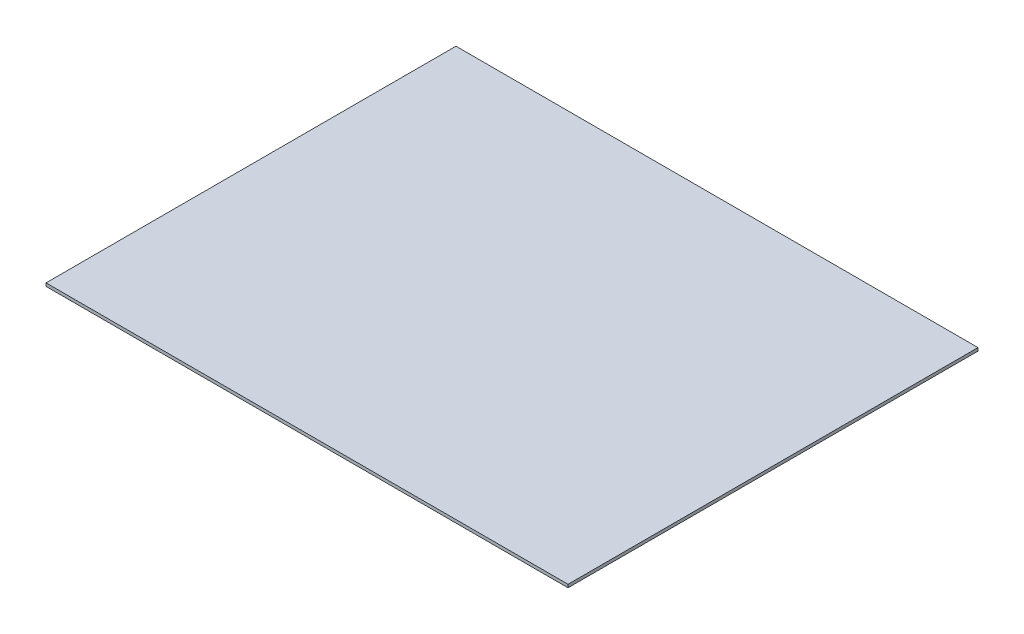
ISO-10303-21;
HEADER;
FILE_DESCRIPTION(('STEP AP214'),'2;1');
FILE_NAME('part.step','',(''),(''),'','','');
FILE_SCHEMA(('AUTOMOTIVE_DESIGN { 1 0 10303 214 1 1 1 1 }'));
ENDSEC;
DATA;
#1=APPLICATION_CONTEXT('core data for automotive mechanical design processes');
#2=APPLICATION_PROTOCOL_DEFINITION('international standard','automotive_design',2000,#1);
#3=PRODUCT_CONTEXT('',#1,'mechanical');
#4=PRODUCT('Part','Part','',(#3));
#5=PRODUCT_RELATED_PRODUCT_CATEGORY('part','',(#4));
#6=PRODUCT_DEFINITION_FORMATION('','',#4);
#7=PRODUCT_DEFINITION_CONTEXT('part definition',#1,'design');
#8=PRODUCT_DEFINITION('design','',#6,#7);
#9=PRODUCT_DEFINITION_SHAPE('','',#8);
#10=(LENGTH_UNIT() NAMED_UNIT(*) SI_UNIT(.MILLI.,.METRE.));
#11=(NAMED_UNIT(*) PLANE_ANGLE_UNIT() SI_UNIT($,.RADIAN.));
#12=(NAMED_UNIT(*) SI_UNIT($,.STERADIAN.) SOLID_ANGLE_UNIT());
#13=UNCERTAINTY_MEASURE_WITH_UNIT(LENGTH_MEASURE(1.E-05),#10,'distance_accuracy_value','');
#14=(GEOMETRIC_REPRESENTATION_CONTEXT(3) GLOBAL_UNCERTAINTY_ASSIGNED_CONTEXT((#13)) GLOBAL_UNIT_ASSIGNED_CONTEXT((#10,
#11,#12)) REPRESENTATION_CONTEXT('',''));
#15=CARTESIAN_POINT('',(0.,0.,0.));
#16=DIRECTION('',(0.,0.,1.));
#17=DIRECTION('',(1.,0.,0.));
#18=AXIS2_PLACEMENT_3D('',#15,#16,#17);
#19=CARTESIAN_POINT('',(170.,2.,133.5));
#20=DIRECTION('',(-1.,0.,0.));
#21=DIRECTION('',(0.,0.,1.));
#22=AXIS2_PLACEMENT_3D('',#19,#20,#21);
#23=PLANE('',#22);
#24=DIRECTION('',(0.,0.,-1.));
#25=VECTOR('',#24,1.);
#26=CARTESIAN_POINT('',(170.,0.,133.5));
#27=LINE('',#26,#25);
#28=CARTESIAN_POINT('',(170.,0.,133.5));
#29=VERTEX_POINT('',#28);
#30=CARTESIAN_POINT('',(170.,0.,-133.5));
#31=VERTEX_POINT('',#30);
#32=EDGE_CURVE('E93',#29,#31,#27,.T.);
#33=ORIENTED_EDGE('',*,*,#32,.T.);
#34=DIRECTION('',(0.,-1.,0.));
#35=VECTOR('',#34,1.);
#36=CARTESIAN_POINT('',(170.,2.,-133.5));
#37=LINE('',#36,#35);
#38=CARTESIAN_POINT('',(170.,2.,-133.5));
#39=VERTEX_POINT('',#38);
#40=EDGE_CURVE('E11',#39,#31,#37,.T.);
#41=ORIENTED_EDGE('',*,*,#40,.F.);
#42=DIRECTION('',(0.,0.,-1.));
#43=VECTOR('',#42,1.);
#44=CARTESIAN_POINT('',(170.,2.,133.5));
#45=LINE('',#44,#43);
#46=CARTESIAN_POINT('',(170.,2.,133.5));
#47=VERTEX_POINT('',#46);
#48=EDGE_CURVE('E81',#47,#39,#45,.T.);
#49=ORIENTED_EDGE('',*,*,#48,.F.);
#50=DIRECTION('',(0.,-1.,0.));
#51=VECTOR('',#50,1.);
#52=CARTESIAN_POINT('',(170.,2.,133.5));
#53=LINE('',#52,#51);
#54=EDGE_CURVE('E89',#47,#29,#53,.T.);
#55=ORIENTED_EDGE('',*,*,#54,.T.);
#56=EDGE_LOOP('',(#33,#41,#49,#55));
#57=FACE_BOUND('',#56,.T.);
#58=ADVANCED_FACE('F30',(#57),#23,.F.);
#59=CARTESIAN_POINT('',(-170.,2.,-133.5));
#60=DIRECTION('',(0.,0.,1.));
#61=DIRECTION('',(1.,0.,0.));
#62=AXIS2_PLACEMENT_3D('',#59,#60,#61);
#63=PLANE('',#62);
#64=DIRECTION('',(-1.,0.,0.));
#65=VECTOR('',#64,1.);
#66=CARTESIAN_POINT('',(-170.,0.,-133.5));
#67=LINE('',#66,#65);
#68=CARTESIAN_POINT('',(-170.,0.,-133.5));
#69=VERTEX_POINT('',#68);
#70=EDGE_CURVE('E85',#31,#69,#67,.T.);
#71=ORIENTED_EDGE('',*,*,#70,.T.);
#72=DIRECTION('',(0.,-1.,0.));
#73=VECTOR('',#72,1.);
#74=CARTESIAN_POINT('',(-170.,2.,-133.5));
#75=LINE('',#74,#73);
#76=CARTESIAN_POINT('',(-170.,2.,-133.5));
#77=VERTEX_POINT('',#76);
#78=EDGE_CURVE('E38',#77,#69,#75,.T.);
#79=ORIENTED_EDGE('',*,*,#78,.F.);
#80=DIRECTION('',(-1.,0.,0.));
#81=VECTOR('',#80,1.);
#82=CARTESIAN_POINT('',(-170.,2.,-133.5));
#83=LINE('',#82,#81);
#84=EDGE_CURVE('E76',#39,#77,#83,.T.);
#85=ORIENTED_EDGE('',*,*,#84,.F.);
#86=ORIENTED_EDGE('',*,*,#40,.T.);
#87=EDGE_LOOP('',(#71,#79,#85,#86));
#88=FACE_BOUND('',#87,.T.);
#89=ADVANCED_FACE('F84',(#88),#63,.F.);
#90=CARTESIAN_POINT('',(-170.,2.,133.5));
#91=DIRECTION('',(1.,0.,0.));
#92=DIRECTION('',(0.,0.,-1.));
#93=AXIS2_PLACEMENT_3D('',#90,#91,#92);
#94=PLANE('',#93);
#95=DIRECTION('',(0.,0.,1.));
#96=VECTOR('',#95,1.);
#97=CARTESIAN_POINT('',(-170.,0.,133.5));
#98=LINE('',#97,#96);
#99=CARTESIAN_POINT('',(-170.,0.,133.5));
#100=VERTEX_POINT('',#99);
#101=EDGE_CURVE('E63',#69,#100,#98,.T.);
#102=ORIENTED_EDGE('',*,*,#101,.T.);
#103=DIRECTION('',(0.,-1.,0.));
#104=VECTOR('',#103,1.);
#105=CARTESIAN_POINT('',(-170.,2.,133.5));
#106=LINE('',#105,#104);
#107=CARTESIAN_POINT('',(-170.,2.,133.5));
#108=VERTEX_POINT('',#107);
#109=EDGE_CURVE('E86',#108,#100,#106,.T.);
#110=ORIENTED_EDGE('',*,*,#109,.F.);
#111=DIRECTION('',(0.,0.,1.));
#112=VECTOR('',#111,1.);
#113=CARTESIAN_POINT('',(-170.,2.,133.5));
#114=LINE('',#113,#112);
#115=EDGE_CURVE('E79',#77,#108,#114,.T.);
#116=ORIENTED_EDGE('',*,*,#115,.F.);
#117=ORIENTED_EDGE('',*,*,#78,.T.);
#118=EDGE_LOOP('',(#102,#110,#116,#117));
#119=FACE_BOUND('',#118,.T.);
#120=ADVANCED_FACE('F87',(#119),#94,.F.);
#121=CARTESIAN_POINT('',(-170.,2.,133.5));
#122=DIRECTION('',(0.,0.,-1.));
#123=DIRECTION('',(-1.,0.,0.));
#124=AXIS2_PLACEMENT_3D('',#121,#122,#123);
#125=PLANE('',#124);
#126=DIRECTION('',(1.,0.,0.));
#127=VECTOR('',#126,1.);
#128=CARTESIAN_POINT('',(-170.,0.,133.5));
#129=LINE('',#128,#127);
#130=EDGE_CURVE('E69',#100,#29,#129,.T.);
#131=ORIENTED_EDGE('',*,*,#130,.T.);
#132=ORIENTED_EDGE('',*,*,#54,.F.);
#133=DIRECTION('',(1.,0.,0.));
#134=VECTOR('',#133,1.);
#135=CARTESIAN_POINT('',(-170.,2.,133.5));
#136=LINE('',#135,#134);
#137=EDGE_CURVE('E46',#108,#47,#136,.T.);
#138=ORIENTED_EDGE('',*,*,#137,.F.);
#139=ORIENTED_EDGE('',*,*,#109,.T.);
#140=EDGE_LOOP('',(#131,#132,#138,#139));
#141=FACE_BOUND('',#140,.T.);
#142=ADVANCED_FACE('F100',(#141),#125,.F.);
#143=CARTESIAN_POINT('',(170.,2.,-133.5));
#144=DIRECTION('',(0.,-1.,0.));
#145=DIRECTION('',(0.,0.,-1.));
#146=AXIS2_PLACEMENT_3D('',#143,#144,#145);
#147=PLANE('',#146);
#148=ORIENTED_EDGE('',*,*,#48,.T.);
#149=ORIENTED_EDGE('',*,*,#84,.T.);
#150=ORIENTED_EDGE('',*,*,#115,.T.);
#151=ORIENTED_EDGE('',*,*,#137,.T.);
#152=EDGE_LOOP('',(#148,#149,#150,#151));
#153=FACE_BOUND('',#152,.T.);
#154=ADVANCED_FACE('F77',(#153),#147,.F.);
#155=CARTESIAN_POINT('',(170.,0.,-133.5));
#156=DIRECTION('',(0.,-1.,0.));
#157=DIRECTION('',(0.,0.,-1.));
#158=AXIS2_PLACEMENT_3D('',#155,#156,#157);
#159=PLANE('',#158);
#160=ORIENTED_EDGE('',*,*,#32,.F.);
#161=ORIENTED_EDGE('',*,*,#130,.F.);
#162=ORIENTED_EDGE('',*,*,#101,.F.);
#163=ORIENTED_EDGE('',*,*,#70,.F.);
#164=EDGE_LOOP('',(#160,#161,#162,#163));
#165=FACE_BOUND('',#164,.T.);
#166=ADVANCED_FACE('F103',(#165),#159,.T.);
#167=CLOSED_SHELL('',(#58,#89,#120,#142,#154,#166));
#168=MANIFOLD_SOLID_BREP('B2',#167);
#169=ADVANCED_BREP_SHAPE_REPRESENTATION('',(#18,#168),#14);
#170=SHAPE_DEFINITION_REPRESENTATION(#9,#169);
ENDSEC;
END-ISO-10303-21;
